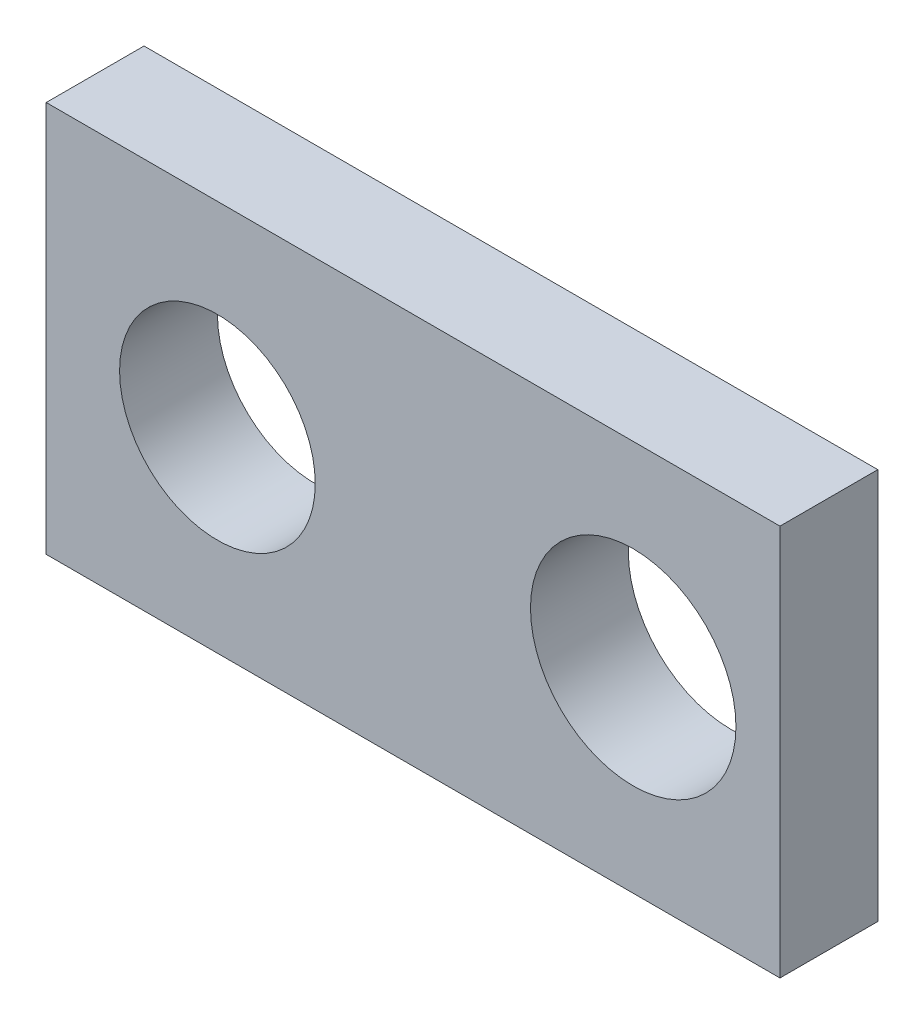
from build123d import *

# Parameters (mm, degrees)
ESQUISSE1_W             = 150
ESQUISSE1_H             = 80
BASE_EXTRUSION_DEPTH    = 20
ESQUISSE2_R             = 21
ESQUISSE2_R_2           = 20
ENL_V_MAT_EXTRU_1_DEPTH = 172.172427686


with BuildPart() as part:
    # Esquisse1 → Base-Extrusion (new body)
    with BuildSketch(Plane.XY):
        with Locations((75, 40)):
            Rectangle(ESQUISSE1_W, ESQUISSE1_H)
    extrude(amount=BASE_EXTRUSION_DEPTH)

    # Esquisse2 → Enl_v. mat.-Extru.1 (cut, through all)
    with BuildSketch(Plane.XY.offset(20)):
        with Locations((120, 40)):
            Circle(ESQUISSE2_R)
        with Locations((35, 40)):
            Circle(ESQUISSE2_R_2)
    extrude(amount=-ENL_V_MAT_EXTRU_1_DEPTH, mode=Mode.SUBTRACT)


solid = part.part
